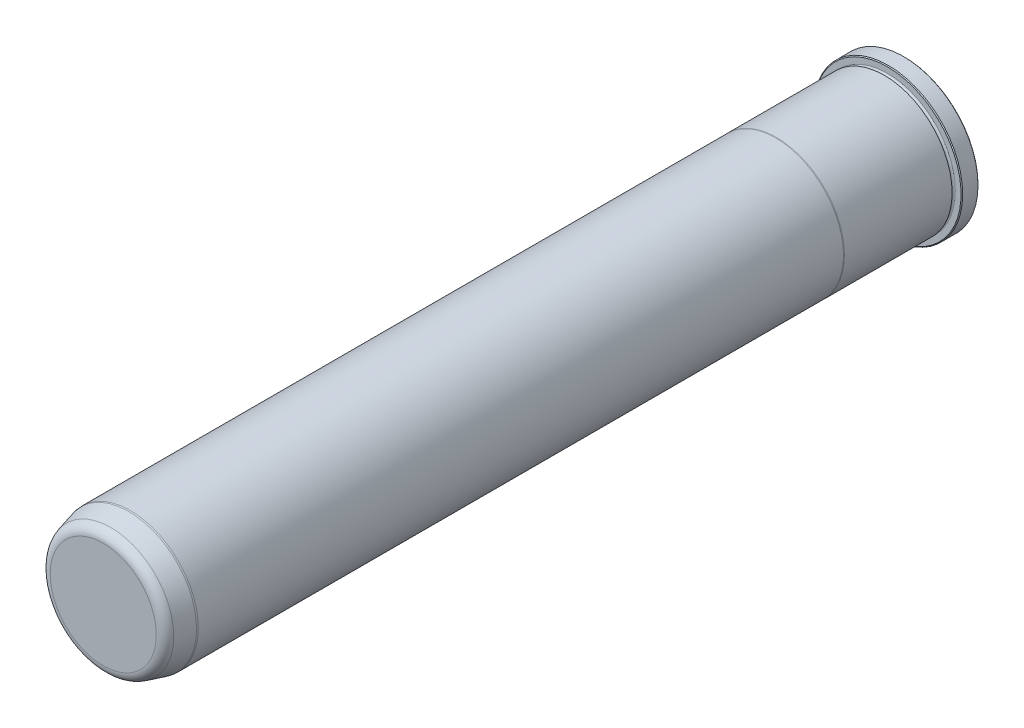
ISO-10303-21;
HEADER;
FILE_DESCRIPTION(('STEP AP214'),'2;1');
FILE_NAME('part.step','',(''),(''),'','','');
FILE_SCHEMA(('AUTOMOTIVE_DESIGN { 1 0 10303 214 1 1 1 1 }'));
ENDSEC;
DATA;
#1=APPLICATION_CONTEXT('core data for automotive mechanical design processes');
#2=APPLICATION_PROTOCOL_DEFINITION('international standard','automotive_design',2000,#1);
#3=PRODUCT_CONTEXT('',#1,'mechanical');
#4=PRODUCT('Part','Part','',(#3));
#5=PRODUCT_RELATED_PRODUCT_CATEGORY('part','',(#4));
#6=PRODUCT_DEFINITION_FORMATION('','',#4);
#7=PRODUCT_DEFINITION_CONTEXT('part definition',#1,'design');
#8=PRODUCT_DEFINITION('design','',#6,#7);
#9=PRODUCT_DEFINITION_SHAPE('','',#8);
#10=(LENGTH_UNIT() NAMED_UNIT(*) SI_UNIT(.MILLI.,.METRE.));
#11=(NAMED_UNIT(*) PLANE_ANGLE_UNIT() SI_UNIT($,.RADIAN.));
#12=(NAMED_UNIT(*) SI_UNIT($,.STERADIAN.) SOLID_ANGLE_UNIT());
#13=UNCERTAINTY_MEASURE_WITH_UNIT(LENGTH_MEASURE(1.E-05),#10,'distance_accuracy_value','');
#14=(GEOMETRIC_REPRESENTATION_CONTEXT(3) GLOBAL_UNCERTAINTY_ASSIGNED_CONTEXT((#13)) GLOBAL_UNIT_ASSIGNED_CONTEXT((#10,
#11,#12)) REPRESENTATION_CONTEXT('',''));
#15=CARTESIAN_POINT('',(0.,0.,0.));
#16=DIRECTION('',(0.,0.,1.));
#17=DIRECTION('',(1.,0.,0.));
#18=AXIS2_PLACEMENT_3D('',#15,#16,#17);
#19=CARTESIAN_POINT('',(0.,0.,0.));
#20=DIRECTION('',(0.,0.,1.));
#21=DIRECTION('',(1.,0.,0.));
#22=AXIS2_PLACEMENT_3D('',#19,#20,#21);
#23=PLANE('',#22);
#24=CARTESIAN_POINT('',(0.,0.,0.));
#25=DIRECTION('',(0.,0.,1.));
#26=DIRECTION('',(1.,0.,0.));
#27=AXIS2_PLACEMENT_3D('',#24,#25,#26);
#28=CIRCLE('',#27,34.417);
#29=CARTESIAN_POINT('',(34.417,0.,0.));
#30=VERTEX_POINT('',#29);
#31=EDGE_CURVE('E37',#30,#30,#28,.F.);
#32=ORIENTED_EDGE('',*,*,#31,.T.);
#33=EDGE_LOOP('',(#32));
#34=FACE_BOUND('',#33,.T.);
#35=ADVANCED_FACE('F30',(#34),#23,.F.);
#36=CARTESIAN_POINT('',(0.,0.,0.));
#37=DIRECTION('',(0.,0.,1.));
#38=DIRECTION('',(1.,0.,0.));
#39=AXIS2_PLACEMENT_3D('',#36,#37,#38);
#40=CYLINDRICAL_SURFACE('',#39,34.798);
#41=CARTESIAN_POINT('',(0.,0.,0.380999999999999));
#42=DIRECTION('',(0.,0.,1.));
#43=DIRECTION('',(1.,0.,0.));
#44=AXIS2_PLACEMENT_3D('',#41,#42,#43);
#45=CIRCLE('',#44,34.798);
#46=CARTESIAN_POINT('',(34.798,0.,0.380999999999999));
#47=VERTEX_POINT('',#46);
#48=EDGE_CURVE('E41',#47,#47,#45,.T.);
#49=ORIENTED_EDGE('',*,*,#48,.T.);
#50=EDGE_LOOP('',(#49));
#51=FACE_BOUND('',#50,.T.);
#52=CARTESIAN_POINT('',(0.,0.,7.54379999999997));
#53=DIRECTION('',(0.,0.,-1.));
#54=DIRECTION('',(-1.,0.,0.));
#55=AXIS2_PLACEMENT_3D('',#52,#53,#54);
#56=CIRCLE('',#55,34.798);
#57=CARTESIAN_POINT('',(-34.798,0.,7.54379999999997));
#58=VERTEX_POINT('',#57);
#59=EDGE_CURVE('E45',#58,#58,#56,.T.);
#60=ORIENTED_EDGE('',*,*,#59,.T.);
#61=EDGE_LOOP('',(#60));
#62=FACE_BOUND('',#61,.T.);
#63=ADVANCED_FACE('F118',(#51,#62),#40,.T.);
#64=CARTESIAN_POINT('',(0.,34.798,7.9248));
#65=DIRECTION('',(0.,0.,-1.));
#66=DIRECTION('',(-1.,0.,0.));
#67=AXIS2_PLACEMENT_3D('',#64,#65,#66);
#68=PLANE('',#67);
#69=CARTESIAN_POINT('',(0.,0.,7.9248));
#70=DIRECTION('',(0.,0.,-1.));
#71=DIRECTION('',(-1.,0.,0.));
#72=AXIS2_PLACEMENT_3D('',#69,#70,#71);
#73=CIRCLE('',#72,34.417);
#74=CARTESIAN_POINT('',(-34.417,0.,7.9248));
#75=VERTEX_POINT('',#74);
#76=EDGE_CURVE('E10',#75,#75,#73,.F.);
#77=ORIENTED_EDGE('',*,*,#76,.T.);
#78=EDGE_LOOP('',(#77));
#79=FACE_BOUND('',#78,.T.);
#80=CARTESIAN_POINT('',(0.,0.,7.9248));
#81=DIRECTION('',(0.,0.,1.));
#82=DIRECTION('',(1.,0.,0.));
#83=AXIS2_PLACEMENT_3D('',#80,#81,#82);
#84=CIRCLE('',#83,31.7373);
#85=CARTESIAN_POINT('',(31.7373,0.,7.9248));
#86=VERTEX_POINT('',#85);
#87=EDGE_CURVE('E56',#86,#86,#84,.T.);
#88=ORIENTED_EDGE('',*,*,#87,.F.);
#89=EDGE_LOOP('',(#88));
#90=FACE_BOUND('',#89,.T.);
#91=ADVANCED_FACE('F113',(#79,#90),#68,.F.);
#92=CARTESIAN_POINT('',(0.,0.,8.6868));
#93=DIRECTION('',(0.,0.,1.));
#94=DIRECTION('',(1.,0.,0.));
#95=AXIS2_PLACEMENT_3D('',#92,#93,#94);
#96=TOROIDAL_SURFACE('',#95,31.7373,0.761999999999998);
#97=CARTESIAN_POINT('',(0.,0.,9.44879999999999));
#98=DIRECTION('',(0.,0.,1.));
#99=DIRECTION('',(1.,0.,0.));
#100=AXIS2_PLACEMENT_3D('',#97,#98,#99);
#101=CIRCLE('',#100,31.7373);
#102=CARTESIAN_POINT('',(31.7373,0.,9.44879999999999));
#103=VERTEX_POINT('',#102);
#104=EDGE_CURVE('E59',#103,#103,#101,.T.);
#105=ORIENTED_EDGE('',*,*,#104,.F.);
#106=EDGE_LOOP('',(#105));
#107=FACE_BOUND('',#106,.T.);
#108=ORIENTED_EDGE('',*,*,#87,.T.);
#109=EDGE_LOOP('',(#108));
#110=FACE_BOUND('',#109,.T.);
#111=ADVANCED_FACE('F107',(#107,#110),#96,.F.);
#112=CARTESIAN_POINT('',(0.,31.7373,9.44879999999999));
#113=DIRECTION('',(0.,0.,1.));
#114=DIRECTION('',(1.,0.,0.));
#115=AXIS2_PLACEMENT_3D('',#112,#113,#114);
#116=PLANE('',#115);
#117=CARTESIAN_POINT('',(0.,0.,9.4488));
#118=DIRECTION('',(0.,0.,1.));
#119=DIRECTION('',(1.,0.,0.));
#120=AXIS2_PLACEMENT_3D('',#117,#118,#119);
#121=CIRCLE('',#120,31.7627);
#122=CARTESIAN_POINT('',(31.7627,0.,9.4488));
#123=VERTEX_POINT('',#122);
#124=EDGE_CURVE('E62',#123,#123,#121,.T.);
#125=ORIENTED_EDGE('',*,*,#124,.F.);
#126=EDGE_LOOP('',(#125));
#127=FACE_BOUND('',#126,.T.);
#128=ORIENTED_EDGE('',*,*,#104,.T.);
#129=EDGE_LOOP('',(#128));
#130=FACE_BOUND('',#129,.T.);
#131=ADVANCED_FACE('F101',(#127,#130),#116,.F.);
#132=CARTESIAN_POINT('',(0.,0.,0.));
#133=DIRECTION('',(0.,0.,1.));
#134=DIRECTION('',(1.,0.,0.));
#135=AXIS2_PLACEMENT_3D('',#132,#133,#134);
#136=CYLINDRICAL_SURFACE('',#135,31.7627);
#137=CARTESIAN_POINT('',(0.,0.,59.8347630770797));
#138=DIRECTION('',(0.,0.,1.));
#139=DIRECTION('',(1.,0.,0.));
#140=AXIS2_PLACEMENT_3D('',#137,#138,#139);
#141=CIRCLE('',#140,31.7627);
#142=CARTESIAN_POINT('',(31.7627,0.,59.8347630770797));
#143=VERTEX_POINT('',#142);
#144=EDGE_CURVE('E65',#143,#143,#141,.T.);
#145=ORIENTED_EDGE('',*,*,#144,.F.);
#146=EDGE_LOOP('',(#145));
#147=FACE_BOUND('',#146,.T.);
#148=ORIENTED_EDGE('',*,*,#124,.T.);
#149=EDGE_LOOP('',(#148));
#150=FACE_BOUND('',#149,.T.);
#151=ADVANCED_FACE('F95',(#147,#150),#136,.T.);
#152=CARTESIAN_POINT('',(0.,0.,59.8347630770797));
#153=DIRECTION('',(0.,0.,-1.));
#154=DIRECTION('',(-1.,0.,0.));
#155=AXIS2_PLACEMENT_3D('',#152,#153,#154);
#156=CONICAL_SURFACE('',#155,31.7627,0.0698131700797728);
#157=CARTESIAN_POINT('',(0.,0.,60.198));
#158=DIRECTION('',(0.,0.,1.));
#159=DIRECTION('',(1.,0.,0.));
#160=AXIS2_PLACEMENT_3D('',#157,#158,#159);
#161=CIRCLE('',#160,31.7373);
#162=CARTESIAN_POINT('',(31.7373,0.,60.198));
#163=VERTEX_POINT('',#162);
#164=EDGE_CURVE('E68',#163,#163,#161,.T.);
#165=ORIENTED_EDGE('',*,*,#164,.F.);
#166=EDGE_LOOP('',(#165));
#167=FACE_BOUND('',#166,.T.);
#168=ORIENTED_EDGE('',*,*,#144,.T.);
#169=EDGE_LOOP('',(#168));
#170=FACE_BOUND('',#169,.T.);
#171=ADVANCED_FACE('F89',(#167,#170),#156,.T.);
#172=CARTESIAN_POINT('',(0.,0.,0.));
#173=DIRECTION('',(0.,0.,1.));
#174=DIRECTION('',(1.,0.,0.));
#175=AXIS2_PLACEMENT_3D('',#172,#173,#174);
#176=CYLINDRICAL_SURFACE('',#175,31.7373);
#177=CARTESIAN_POINT('',(0.,0.,361.95));
#178=DIRECTION('',(0.,0.,1.));
#179=DIRECTION('',(1.,0.,0.));
#180=AXIS2_PLACEMENT_3D('',#177,#178,#179);
#181=CIRCLE('',#180,31.7373);
#182=CARTESIAN_POINT('',(31.7373,0.,361.95));
#183=VERTEX_POINT('',#182);
#184=EDGE_CURVE('E71',#183,#183,#181,.T.);
#185=ORIENTED_EDGE('',*,*,#184,.F.);
#186=EDGE_LOOP('',(#185));
#187=FACE_BOUND('',#186,.T.);
#188=ORIENTED_EDGE('',*,*,#164,.T.);
#189=EDGE_LOOP('',(#188));
#190=FACE_BOUND('',#189,.T.);
#191=ADVANCED_FACE('F83',(#187,#190),#176,.T.);
#192=CARTESIAN_POINT('',(0.,0.,361.95));
#193=DIRECTION('',(0.,0.,-1.));
#194=DIRECTION('',(-1.,0.,0.));
#195=AXIS2_PLACEMENT_3D('',#192,#193,#194);
#196=CONICAL_SURFACE('',#195,31.7373,0.0872664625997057);
#197=CARTESIAN_POINT('',(0.,0.,362.712));
#198=DIRECTION('',(0.,0.,1.));
#199=DIRECTION('',(1.,0.,0.));
#200=AXIS2_PLACEMENT_3D('',#197,#198,#199);
#201=CIRCLE('',#200,31.6706336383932);
#202=CARTESIAN_POINT('',(31.6706336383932,0.,362.712));
#203=VERTEX_POINT('',#202);
#204=EDGE_CURVE('E74',#203,#203,#201,.T.);
#205=ORIENTED_EDGE('',*,*,#204,.F.);
#206=EDGE_LOOP('',(#205));
#207=FACE_BOUND('',#206,.T.);
#208=ORIENTED_EDGE('',*,*,#184,.T.);
#209=EDGE_LOOP('',(#208));
#210=FACE_BOUND('',#209,.T.);
#211=ADVANCED_FACE('F80',(#207,#210),#196,.T.);
#212=CARTESIAN_POINT('',(0.,0.,362.712));
#213=DIRECTION('',(0.,0.,-1.));
#214=DIRECTION('',(-1.,0.,0.));
#215=AXIS2_PLACEMENT_3D('',#212,#213,#214);
#216=CONICAL_SURFACE('',#215,31.6706336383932,0.261799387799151);
#217=CARTESIAN_POINT('',(0.,0.,371.120125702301));
#218=DIRECTION('',(0.,0.,1.));
#219=DIRECTION('',(1.,0.,0.));
#220=AXIS2_PLACEMENT_3D('',#217,#218,#219);
#221=CIRCLE('',#220,29.4176831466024);
#222=CARTESIAN_POINT('',(29.4176831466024,0.,371.120125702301));
#223=VERTEX_POINT('',#222);
#224=EDGE_CURVE('E50',#223,#223,#221,.F.);
#225=ORIENTED_EDGE('',*,*,#224,.T.);
#226=EDGE_LOOP('',(#225));
#227=FACE_BOUND('',#226,.T.);
#228=ORIENTED_EDGE('',*,*,#204,.T.);
#229=EDGE_LOOP('',(#228));
#230=FACE_BOUND('',#229,.T.);
#231=ADVANCED_FACE('F78',(#227,#230),#216,.T.);
#232=CARTESIAN_POINT('',(0.,28.4718561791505,374.65));
#233=DIRECTION('',(0.,0.,-1.));
#234=DIRECTION('',(-1.,0.,0.));
#235=AXIS2_PLACEMENT_3D('',#232,#233,#234);
#236=PLANE('',#235);
#237=CARTESIAN_POINT('',(0.,0.,374.65));
#238=DIRECTION('',(0.,0.,-1.));
#239=DIRECTION('',(-1.,0.,0.));
#240=AXIS2_PLACEMENT_3D('',#237,#238,#239);
#241=CIRCLE('',#240,24.8174613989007);
#242=CARTESIAN_POINT('',(-24.8174613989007,0.,374.65));
#243=VERTEX_POINT('',#242);
#244=EDGE_CURVE('E53',#243,#243,#241,.F.);
#245=ORIENTED_EDGE('',*,*,#244,.T.);
#246=EDGE_LOOP('',(#245));
#247=FACE_BOUND('',#246,.T.);
#248=ADVANCED_FACE('F133',(#247),#236,.F.);
#249=CARTESIAN_POINT('',(0.,0.,369.8875));
#250=DIRECTION('',(0.,0.,-1.));
#251=DIRECTION('',(-1.,0.,0.));
#252=AXIS2_PLACEMENT_3D('',#249,#250,#251);
#253=TOROIDAL_SURFACE('',#252,24.8174613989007,4.7625);
#254=ORIENTED_EDGE('',*,*,#224,.F.);
#255=EDGE_LOOP('',(#254));
#256=FACE_BOUND('',#255,.T.);
#257=ORIENTED_EDGE('',*,*,#244,.F.);
#258=EDGE_LOOP('',(#257));
#259=FACE_BOUND('',#258,.T.);
#260=ADVANCED_FACE('F130',(#256,#259),#253,.T.);
#261=CARTESIAN_POINT('',(0.,0.,0.380999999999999));
#262=DIRECTION('',(0.,0.,1.));
#263=DIRECTION('',(1.,0.,0.));
#264=AXIS2_PLACEMENT_3D('',#261,#262,#263);
#265=CONICAL_SURFACE('',#264,34.798,0.785398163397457);
#266=ORIENTED_EDGE('',*,*,#31,.F.);
#267=EDGE_LOOP('',(#266));
#268=FACE_BOUND('',#267,.T.);
#269=ORIENTED_EDGE('',*,*,#48,.F.);
#270=EDGE_LOOP('',(#269));
#271=FACE_BOUND('',#270,.T.);
#272=ADVANCED_FACE('F132',(#268,#271),#265,.T.);
#273=CARTESIAN_POINT('',(0.,0.,7.9248));
#274=DIRECTION('',(0.,0.,-1.));
#275=DIRECTION('',(-1.,0.,0.));
#276=AXIS2_PLACEMENT_3D('',#273,#274,#275);
#277=CONICAL_SURFACE('',#276,34.417,0.785398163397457);
#278=ORIENTED_EDGE('',*,*,#59,.F.);
#279=EDGE_LOOP('',(#278));
#280=FACE_BOUND('',#279,.T.);
#281=ORIENTED_EDGE('',*,*,#76,.F.);
#282=EDGE_LOOP('',(#281));
#283=FACE_BOUND('',#282,.T.);
#284=ADVANCED_FACE('F32',(#280,#283),#277,.T.);
#285=CLOSED_SHELL('',(#35,#63,#91,#111,#131,#151,#171,#191,#211,#231,#248,#260,#272,#284));
#286=MANIFOLD_SOLID_BREP('B2',#285);
#287=ADVANCED_BREP_SHAPE_REPRESENTATION('',(#18,#286),#14);
#288=SHAPE_DEFINITION_REPRESENTATION(#9,#287);
ENDSEC;
END-ISO-10303-21;
